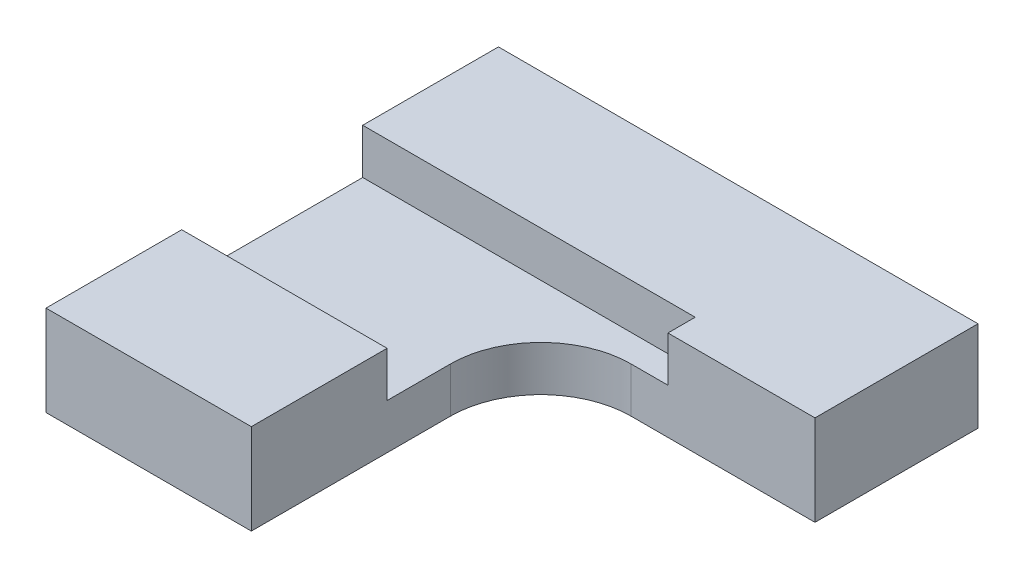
ISO-10303-21;
HEADER;
FILE_DESCRIPTION(('STEP AP214'),'2;1');
FILE_NAME('part.step','',(''),(''),'','','');
FILE_SCHEMA(('AUTOMOTIVE_DESIGN { 1 0 10303 214 1 1 1 1 }'));
ENDSEC;
DATA;
#1=APPLICATION_CONTEXT('core data for automotive mechanical design processes');
#2=APPLICATION_PROTOCOL_DEFINITION('international standard','automotive_design',2000,#1);
#3=PRODUCT_CONTEXT('',#1,'mechanical');
#4=PRODUCT('Part','Part','',(#3));
#5=PRODUCT_RELATED_PRODUCT_CATEGORY('part','',(#4));
#6=PRODUCT_DEFINITION_FORMATION('','',#4);
#7=PRODUCT_DEFINITION_CONTEXT('part definition',#1,'design');
#8=PRODUCT_DEFINITION('design','',#6,#7);
#9=PRODUCT_DEFINITION_SHAPE('','',#8);
#10=(LENGTH_UNIT() NAMED_UNIT(*) SI_UNIT(.MILLI.,.METRE.));
#11=(NAMED_UNIT(*) PLANE_ANGLE_UNIT() SI_UNIT($,.RADIAN.));
#12=(NAMED_UNIT(*) SI_UNIT($,.STERADIAN.) SOLID_ANGLE_UNIT());
#13=UNCERTAINTY_MEASURE_WITH_UNIT(LENGTH_MEASURE(1.E-05),#10,'distance_accuracy_value','');
#14=(GEOMETRIC_REPRESENTATION_CONTEXT(3) GLOBAL_UNCERTAINTY_ASSIGNED_CONTEXT((#13)) GLOBAL_UNIT_ASSIGNED_CONTEXT((#10,
#11,#12)) REPRESENTATION_CONTEXT('',''));
#15=CARTESIAN_POINT('',(0.,0.,0.));
#16=DIRECTION('',(0.,0.,1.));
#17=DIRECTION('',(1.,0.,0.));
#18=AXIS2_PLACEMENT_3D('',#15,#16,#17);
#19=CARTESIAN_POINT('',(5.9443903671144,-10.,3.01596790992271));
#20=DIRECTION('',(0.,1.,0.));
#21=DIRECTION('',(0.,0.,1.));
#22=AXIS2_PLACEMENT_3D('',#19,#20,#21);
#23=CYLINDRICAL_SURFACE('',#22,10.);
#24=CARTESIAN_POINT('',(5.9443903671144,-5.00000000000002,3.01596790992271));
#25=DIRECTION('',(0.,1.,0.));
#26=DIRECTION('',(0.,0.,1.));
#27=AXIS2_PLACEMENT_3D('',#24,#25,#26);
#28=CIRCLE('',#27,10.);
#29=CARTESIAN_POINT('',(-4.0556096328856,-5.00000000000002,3.01596790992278));
#30=VERTEX_POINT('',#29);
#31=CARTESIAN_POINT('',(5.94439036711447,-5.00000000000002,-6.98403209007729));
#32=VERTEX_POINT('',#31);
#33=EDGE_CURVE('E203',#30,#32,#28,.F.);
#34=ORIENTED_EDGE('',*,*,#33,.F.);
#35=DIRECTION('',(0.,1.,0.));
#36=VECTOR('',#35,1.);
#37=CARTESIAN_POINT('',(-4.0556096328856,-10.,3.01596790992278));
#38=LINE('',#37,#36);
#39=CARTESIAN_POINT('',(-4.0556096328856,-10.,3.01596790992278));
#40=VERTEX_POINT('',#39);
#41=EDGE_CURVE('E289',#40,#30,#38,.T.);
#42=ORIENTED_EDGE('',*,*,#41,.F.);
#43=CARTESIAN_POINT('',(5.9443903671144,-10.,3.01596790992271));
#44=DIRECTION('',(0.,1.,0.));
#45=DIRECTION('',(0.,0.,1.));
#46=AXIS2_PLACEMENT_3D('',#43,#44,#45);
#47=CIRCLE('',#46,10.);
#48=CARTESIAN_POINT('',(5.94439036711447,-10.,-6.98403209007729));
#49=VERTEX_POINT('',#48);
#50=EDGE_CURVE('E266',#49,#40,#47,.T.);
#51=ORIENTED_EDGE('',*,*,#50,.F.);
#52=DIRECTION('',(0.,1.,0.));
#53=VECTOR('',#52,1.);
#54=CARTESIAN_POINT('',(5.94439036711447,-10.,-6.98403209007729));
#55=LINE('',#54,#53);
#56=EDGE_CURVE('E292',#49,#32,#55,.T.);
#57=ORIENTED_EDGE('',*,*,#56,.T.);
#58=EDGE_LOOP('',(#34,#42,#51,#57));
#59=FACE_BOUND('',#58,.T.);
#60=ADVANCED_FACE('F33',(#59),#23,.F.);
#61=CARTESIAN_POINT('',(0.,0.,0.));
#62=DIRECTION('',(0.,1.,0.));
#63=DIRECTION('',(0.,0.,1.));
#64=AXIS2_PLACEMENT_3D('',#61,#62,#63);
#65=PLANE('',#64);
#66=DIRECTION('',(-1.,0.,0.));
#67=VECTOR('',#66,1.);
#68=CARTESIAN_POINT('',(0.,0.,-10.));
#69=LINE('',#68,#67);
#70=CARTESIAN_POINT('',(10.,0.,-10.));
#71=VERTEX_POINT('',#70);
#72=CARTESIAN_POINT('',(-26.7491169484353,0.,-10.));
#73=VERTEX_POINT('',#72);
#74=EDGE_CURVE('E41',#71,#73,#69,.T.);
#75=ORIENTED_EDGE('',*,*,#74,.F.);
#76=DIRECTION('',(0.,0.,-1.));
#77=VECTOR('',#76,1.);
#78=CARTESIAN_POINT('',(10.,0.,0.));
#79=LINE('',#78,#77);
#80=CARTESIAN_POINT('',(10.,0.,-6.98403209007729));
#81=VERTEX_POINT('',#80);
#82=EDGE_CURVE('E186',#81,#71,#79,.T.);
#83=ORIENTED_EDGE('',*,*,#82,.F.);
#84=DIRECTION('',(-1.,0.,0.));
#85=VECTOR('',#84,1.);
#86=CARTESIAN_POINT('',(6.0602202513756,0.,-6.98403209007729));
#87=LINE('',#86,#85);
#88=CARTESIAN_POINT('',(26.2508830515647,0.,-6.98403209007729));
#89=VERTEX_POINT('',#88);
#90=EDGE_CURVE('E283',#89,#81,#87,.T.);
#91=ORIENTED_EDGE('',*,*,#90,.F.);
#92=DIRECTION('',(0.,0.,1.));
#93=VECTOR('',#92,1.);
#94=CARTESIAN_POINT('',(26.2508830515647,0.,-25.));
#95=LINE('',#94,#93);
#96=CARTESIAN_POINT('',(26.2508830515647,0.,-25.));
#97=VERTEX_POINT('',#96);
#98=EDGE_CURVE('E280',#97,#89,#95,.T.);
#99=ORIENTED_EDGE('',*,*,#98,.F.);
#100=DIRECTION('',(1.,0.,0.));
#101=VECTOR('',#100,1.);
#102=CARTESIAN_POINT('',(-26.7491169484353,0.,-25.));
#103=LINE('',#102,#101);
#104=CARTESIAN_POINT('',(-26.7491169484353,0.,-25.));
#105=VERTEX_POINT('',#104);
#106=EDGE_CURVE('E277',#105,#97,#103,.T.);
#107=ORIENTED_EDGE('',*,*,#106,.F.);
#108=DIRECTION('',(0.,0.,-1.));
#109=VECTOR('',#108,1.);
#110=CARTESIAN_POINT('',(-26.7491169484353,0.,25.));
#111=LINE('',#110,#109);
#112=EDGE_CURVE('E273',#73,#105,#111,.T.);
#113=ORIENTED_EDGE('',*,*,#112,.F.);
#114=EDGE_LOOP('',(#75,#83,#91,#99,#107,#113));
#115=FACE_BOUND('',#114,.T.);
#116=ADVANCED_FACE('F336',(#115),#65,.T.);
#117=CARTESIAN_POINT('',(-4.0556096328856,-10.,25.));
#118=DIRECTION('',(0.,0.,-1.));
#119=DIRECTION('',(-1.,0.,0.));
#120=AXIS2_PLACEMENT_3D('',#117,#118,#119);
#121=PLANE('',#120);
#122=DIRECTION('',(-1.,0.,0.));
#123=VECTOR('',#122,1.);
#124=CARTESIAN_POINT('',(-4.0556096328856,0.,25.));
#125=LINE('',#124,#123);
#126=CARTESIAN_POINT('',(-4.0556096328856,0.,25.));
#127=VERTEX_POINT('',#126);
#128=CARTESIAN_POINT('',(-26.7491169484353,0.,25.));
#129=VERTEX_POINT('',#128);
#130=EDGE_CURVE('E245',#127,#129,#125,.T.);
#131=ORIENTED_EDGE('',*,*,#130,.T.);
#132=DIRECTION('',(0.,1.,0.));
#133=VECTOR('',#132,1.);
#134=CARTESIAN_POINT('',(-26.7491169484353,-10.,25.));
#135=LINE('',#134,#133);
#136=CARTESIAN_POINT('',(-26.7491169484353,-10.,25.));
#137=VERTEX_POINT('',#136);
#138=EDGE_CURVE('E304',#137,#129,#135,.T.);
#139=ORIENTED_EDGE('',*,*,#138,.F.);
#140=DIRECTION('',(-1.,0.,0.));
#141=VECTOR('',#140,1.);
#142=CARTESIAN_POINT('',(-4.0556096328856,-10.,25.));
#143=LINE('',#142,#141);
#144=CARTESIAN_POINT('',(-4.0556096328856,-10.,25.));
#145=VERTEX_POINT('',#144);
#146=EDGE_CURVE('E252',#145,#137,#143,.T.);
#147=ORIENTED_EDGE('',*,*,#146,.F.);
#148=DIRECTION('',(0.,1.,0.));
#149=VECTOR('',#148,1.);
#150=CARTESIAN_POINT('',(-4.0556096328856,-10.,25.));
#151=LINE('',#150,#149);
#152=EDGE_CURVE('E270',#145,#127,#151,.T.);
#153=ORIENTED_EDGE('',*,*,#152,.T.);
#154=EDGE_LOOP('',(#131,#139,#147,#153));
#155=FACE_BOUND('',#154,.T.);
#156=ADVANCED_FACE('F35',(#155),#121,.F.);
#157=CARTESIAN_POINT('',(-26.7491169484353,-10.,25.));
#158=DIRECTION('',(1.,0.,0.));
#159=DIRECTION('',(0.,0.,-1.));
#160=AXIS2_PLACEMENT_3D('',#157,#158,#159);
#161=PLANE('',#160);
#162=DIRECTION('',(0.,0.,1.));
#163=VECTOR('',#162,1.);
#164=CARTESIAN_POINT('',(-26.7491169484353,-5.00000000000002,25.));
#165=LINE('',#164,#163);
#166=CARTESIAN_POINT('',(-26.7491169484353,-5.00000000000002,-10.));
#167=VERTEX_POINT('',#166);
#168=CARTESIAN_POINT('',(-26.7491169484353,-5.00000000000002,10.));
#169=VERTEX_POINT('',#168);
#170=EDGE_CURVE('E206',#167,#169,#165,.T.);
#171=ORIENTED_EDGE('',*,*,#170,.F.);
#172=DIRECTION('',(0.,1.,0.));
#173=VECTOR('',#172,1.);
#174=CARTESIAN_POINT('',(-26.7491169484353,-10.,-10.));
#175=LINE('',#174,#173);
#176=EDGE_CURVE('E193',#167,#73,#175,.T.);
#177=ORIENTED_EDGE('',*,*,#176,.T.);
#178=ORIENTED_EDGE('',*,*,#112,.T.);
#179=DIRECTION('',(0.,1.,0.));
#180=VECTOR('',#179,1.);
#181=CARTESIAN_POINT('',(-26.7491169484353,-10.,-25.));
#182=LINE('',#181,#180);
#183=CARTESIAN_POINT('',(-26.7491169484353,-10.,-25.));
#184=VERTEX_POINT('',#183);
#185=EDGE_CURVE('E301',#184,#105,#182,.T.);
#186=ORIENTED_EDGE('',*,*,#185,.F.);
#187=DIRECTION('',(0.,0.,-1.));
#188=VECTOR('',#187,1.);
#189=CARTESIAN_POINT('',(-26.7491169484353,-10.,25.));
#190=LINE('',#189,#188);
#191=EDGE_CURVE('E255',#137,#184,#190,.T.);
#192=ORIENTED_EDGE('',*,*,#191,.F.);
#193=ORIENTED_EDGE('',*,*,#138,.T.);
#194=CARTESIAN_POINT('',(-26.7491169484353,0.,10.));
#195=VERTEX_POINT('',#194);
#196=EDGE_CURVE('E274',#129,#195,#111,.T.);
#197=ORIENTED_EDGE('',*,*,#196,.T.);
#198=DIRECTION('',(0.,-1.,0.));
#199=VECTOR('',#198,1.);
#200=CARTESIAN_POINT('',(-26.7491169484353,-10.,10.));
#201=LINE('',#200,#199);
#202=EDGE_CURVE('E48',#195,#169,#201,.T.);
#203=ORIENTED_EDGE('',*,*,#202,.T.);
#204=EDGE_LOOP('',(#171,#177,#178,#186,#192,#193,#197,#203));
#205=FACE_BOUND('',#204,.T.);
#206=ADVANCED_FACE('F333',(#205),#161,.F.);
#207=CARTESIAN_POINT('',(-26.7491169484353,-10.,-25.));
#208=DIRECTION('',(0.,0.,1.));
#209=DIRECTION('',(1.,0.,0.));
#210=AXIS2_PLACEMENT_3D('',#207,#208,#209);
#211=PLANE('',#210);
#212=DIRECTION('',(1.,0.,0.));
#213=VECTOR('',#212,1.);
#214=CARTESIAN_POINT('',(-26.7491169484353,-10.,-25.));
#215=LINE('',#214,#213);
#216=CARTESIAN_POINT('',(3.5,-10.,-25.));
#217=VERTEX_POINT('',#216);
#218=CARTESIAN_POINT('',(26.2508830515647,-10.,-25.));
#219=VERTEX_POINT('',#218);
#220=EDGE_CURVE('E258',#217,#219,#215,.T.);
#221=ORIENTED_EDGE('',*,*,#220,.F.);
#222=DIRECTION('',(0.,1.,0.));
#223=VECTOR('',#222,1.);
#224=CARTESIAN_POINT('',(3.5,-16.,-25.));
#225=LINE('',#224,#223);
#226=CARTESIAN_POINT('',(3.5,-16.,-25.));
#227=VERTEX_POINT('',#226);
#228=EDGE_CURVE('E246',#227,#217,#225,.T.);
#229=ORIENTED_EDGE('',*,*,#228,.F.);
#230=DIRECTION('',(-1.,0.,0.));
#231=VECTOR('',#230,1.);
#232=CARTESIAN_POINT('',(-3.5,-16.,-25.));
#233=LINE('',#232,#231);
#234=CARTESIAN_POINT('',(-3.5,-16.,-25.));
#235=VERTEX_POINT('',#234);
#236=EDGE_CURVE('E238',#227,#235,#233,.T.);
#237=ORIENTED_EDGE('',*,*,#236,.T.);
#238=DIRECTION('',(0.,1.,0.));
#239=VECTOR('',#238,1.);
#240=CARTESIAN_POINT('',(-3.5,-16.,-25.));
#241=LINE('',#240,#239);
#242=CARTESIAN_POINT('',(-3.5,-10.,-25.));
#243=VERTEX_POINT('',#242);
#244=EDGE_CURVE('E242',#235,#243,#241,.T.);
#245=ORIENTED_EDGE('',*,*,#244,.T.);
#246=EDGE_CURVE('E259',#184,#243,#215,.T.);
#247=ORIENTED_EDGE('',*,*,#246,.F.);
#248=ORIENTED_EDGE('',*,*,#185,.T.);
#249=ORIENTED_EDGE('',*,*,#106,.T.);
#250=DIRECTION('',(0.,1.,0.));
#251=VECTOR('',#250,1.);
#252=CARTESIAN_POINT('',(26.2508830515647,-10.,-25.));
#253=LINE('',#252,#251);
#254=EDGE_CURVE('E298',#219,#97,#253,.T.);
#255=ORIENTED_EDGE('',*,*,#254,.F.);
#256=EDGE_LOOP('',(#221,#229,#237,#245,#247,#248,#249,#255));
#257=FACE_BOUND('',#256,.T.);
#258=ADVANCED_FACE('F341',(#257),#211,.F.);
#259=CARTESIAN_POINT('',(26.2508830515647,-10.,-25.));
#260=DIRECTION('',(-1.,0.,0.));
#261=DIRECTION('',(0.,0.,1.));
#262=AXIS2_PLACEMENT_3D('',#259,#260,#261);
#263=PLANE('',#262);
#264=ORIENTED_EDGE('',*,*,#98,.T.);
#265=DIRECTION('',(0.,1.,0.));
#266=VECTOR('',#265,1.);
#267=CARTESIAN_POINT('',(26.2508830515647,-10.,-6.98403209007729));
#268=LINE('',#267,#266);
#269=CARTESIAN_POINT('',(26.2508830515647,-10.,-6.98403209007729));
#270=VERTEX_POINT('',#269);
#271=EDGE_CURVE('E295',#270,#89,#268,.T.);
#272=ORIENTED_EDGE('',*,*,#271,.F.);
#273=DIRECTION('',(0.,0.,1.));
#274=VECTOR('',#273,1.);
#275=CARTESIAN_POINT('',(26.2508830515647,-10.,-25.));
#276=LINE('',#275,#274);
#277=EDGE_CURVE('E262',#219,#270,#276,.T.);
#278=ORIENTED_EDGE('',*,*,#277,.F.);
#279=ORIENTED_EDGE('',*,*,#254,.T.);
#280=EDGE_LOOP('',(#264,#272,#278,#279));
#281=FACE_BOUND('',#280,.T.);
#282=ADVANCED_FACE('F368',(#281),#263,.F.);
#283=CARTESIAN_POINT('',(6.0602202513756,-10.,-6.98403209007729));
#284=DIRECTION('',(0.,0.,-1.));
#285=DIRECTION('',(-1.,0.,0.));
#286=AXIS2_PLACEMENT_3D('',#283,#284,#285);
#287=PLANE('',#286);
#288=ORIENTED_EDGE('',*,*,#90,.T.);
#289=DIRECTION('',(0.,-1.,0.));
#290=VECTOR('',#289,1.);
#291=CARTESIAN_POINT('',(10.,-10.,-6.98403209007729));
#292=LINE('',#291,#290);
#293=CARTESIAN_POINT('',(10.,-5.00000000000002,-6.98403209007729));
#294=VERTEX_POINT('',#293);
#295=EDGE_CURVE('E200',#81,#294,#292,.T.);
#296=ORIENTED_EDGE('',*,*,#295,.T.);
#297=DIRECTION('',(1.,0.,0.));
#298=VECTOR('',#297,1.);
#299=CARTESIAN_POINT('',(6.0602202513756,-5.00000000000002,-6.98403209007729));
#300=LINE('',#299,#298);
#301=EDGE_CURVE('E177',#32,#294,#300,.T.);
#302=ORIENTED_EDGE('',*,*,#301,.F.);
#303=ORIENTED_EDGE('',*,*,#56,.F.);
#304=DIRECTION('',(-1.,0.,0.));
#305=VECTOR('',#304,1.);
#306=CARTESIAN_POINT('',(26.2508830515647,-10.,-6.98403209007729));
#307=LINE('',#306,#305);
#308=EDGE_CURVE('E264',#270,#49,#307,.T.);
#309=ORIENTED_EDGE('',*,*,#308,.F.);
#310=ORIENTED_EDGE('',*,*,#271,.T.);
#311=EDGE_LOOP('',(#288,#296,#302,#303,#309,#310));
#312=FACE_BOUND('',#311,.T.);
#313=ADVANCED_FACE('F365',(#312),#287,.F.);
#314=CARTESIAN_POINT('',(-4.0556096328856,-10.,3.13179779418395));
#315=DIRECTION('',(-1.,0.,0.));
#316=DIRECTION('',(0.,0.,1.));
#317=AXIS2_PLACEMENT_3D('',#314,#315,#316);
#318=PLANE('',#317);
#319=DIRECTION('',(0.,0.,-1.));
#320=VECTOR('',#319,1.);
#321=CARTESIAN_POINT('',(-4.0556096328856,-5.00000000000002,3.13179779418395));
#322=LINE('',#321,#320);
#323=CARTESIAN_POINT('',(-4.0556096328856,-5.00000000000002,10.));
#324=VERTEX_POINT('',#323);
#325=EDGE_CURVE('E11',#324,#30,#322,.T.);
#326=ORIENTED_EDGE('',*,*,#325,.F.);
#327=DIRECTION('',(0.,1.,0.));
#328=VECTOR('',#327,1.);
#329=CARTESIAN_POINT('',(-4.0556096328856,-10.,10.));
#330=LINE('',#329,#328);
#331=CARTESIAN_POINT('',(-4.0556096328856,0.,10.));
#332=VERTEX_POINT('',#331);
#333=EDGE_CURVE('E189',#324,#332,#330,.T.);
#334=ORIENTED_EDGE('',*,*,#333,.T.);
#335=DIRECTION('',(0.,0.,1.));
#336=VECTOR('',#335,1.);
#337=CARTESIAN_POINT('',(-4.0556096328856,0.,3.13179779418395));
#338=LINE('',#337,#336);
#339=EDGE_CURVE('E256',#332,#127,#338,.T.);
#340=ORIENTED_EDGE('',*,*,#339,.T.);
#341=ORIENTED_EDGE('',*,*,#152,.F.);
#342=DIRECTION('',(0.,0.,1.));
#343=VECTOR('',#342,1.);
#344=CARTESIAN_POINT('',(-4.0556096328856,-10.,3.01596790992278));
#345=LINE('',#344,#343);
#346=EDGE_CURVE('E268',#40,#145,#345,.T.);
#347=ORIENTED_EDGE('',*,*,#346,.F.);
#348=ORIENTED_EDGE('',*,*,#41,.T.);
#349=EDGE_LOOP('',(#326,#334,#340,#341,#347,#348));
#350=FACE_BOUND('',#349,.T.);
#351=ADVANCED_FACE('F357',(#350),#318,.F.);
#352=CARTESIAN_POINT('',(5.9443903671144,-10.,3.01596790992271));
#353=DIRECTION('',(0.,1.,0.));
#354=DIRECTION('',(0.,0.,1.));
#355=AXIS2_PLACEMENT_3D('',#352,#353,#354);
#356=PLANE('',#355);
#357=DIRECTION('',(-1.,0.,0.));
#358=VECTOR('',#357,1.);
#359=CARTESIAN_POINT('',(5.9443903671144,-10.,-3.5));
#360=LINE('',#359,#358);
#361=CARTESIAN_POINT('',(-21.2491169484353,-10.,-3.5));
#362=VERTEX_POINT('',#361);
#363=CARTESIAN_POINT('',(-25.2491169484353,-10.,-3.5));
#364=VERTEX_POINT('',#363);
#365=EDGE_CURVE('E322',#362,#364,#360,.T.);
#366=ORIENTED_EDGE('',*,*,#365,.T.);
#367=DIRECTION('',(0.,0.,1.));
#368=VECTOR('',#367,1.);
#369=CARTESIAN_POINT('',(-25.2491169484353,-10.,3.01596790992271));
#370=LINE('',#369,#368);
#371=CARTESIAN_POINT('',(-25.2491169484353,-10.,3.5));
#372=VERTEX_POINT('',#371);
#373=EDGE_CURVE('E325',#364,#372,#370,.T.);
#374=ORIENTED_EDGE('',*,*,#373,.T.);
#375=DIRECTION('',(1.,0.,0.));
#376=VECTOR('',#375,1.);
#377=CARTESIAN_POINT('',(5.9443903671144,-10.,3.5));
#378=LINE('',#377,#376);
#379=CARTESIAN_POINT('',(-21.2491169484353,-10.,3.5));
#380=VERTEX_POINT('',#379);
#381=EDGE_CURVE('E316',#372,#380,#378,.T.);
#382=ORIENTED_EDGE('',*,*,#381,.T.);
#383=DIRECTION('',(0.,0.,-1.));
#384=VECTOR('',#383,1.);
#385=CARTESIAN_POINT('',(-21.2491169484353,-10.,3.01596790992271));
#386=LINE('',#385,#384);
#387=EDGE_CURVE('E319',#380,#362,#386,.T.);
#388=ORIENTED_EDGE('',*,*,#387,.T.);
#389=EDGE_LOOP('',(#366,#374,#382,#388));
#390=FACE_BOUND('',#389,.T.);
#391=ORIENTED_EDGE('',*,*,#246,.T.);
#392=DIRECTION('',(0.,0.,1.));
#393=VECTOR('',#392,1.);
#394=CARTESIAN_POINT('',(-3.5,-10.,3.01596790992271));
#395=LINE('',#394,#393);
#396=CARTESIAN_POINT('',(-3.5,-10.,-21.));
#397=VERTEX_POINT('',#396);
#398=EDGE_CURVE('E313',#243,#397,#395,.T.);
#399=ORIENTED_EDGE('',*,*,#398,.T.);
#400=DIRECTION('',(1.,0.,0.));
#401=VECTOR('',#400,1.);
#402=CARTESIAN_POINT('',(5.9443903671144,-10.,-21.));
#403=LINE('',#402,#401);
#404=CARTESIAN_POINT('',(3.5,-10.,-21.));
#405=VERTEX_POINT('',#404);
#406=EDGE_CURVE('E307',#397,#405,#403,.T.);
#407=ORIENTED_EDGE('',*,*,#406,.T.);
#408=DIRECTION('',(0.,0.,-1.));
#409=VECTOR('',#408,1.);
#410=CARTESIAN_POINT('',(3.5,-10.,3.01596790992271));
#411=LINE('',#410,#409);
#412=EDGE_CURVE('E310',#405,#217,#411,.T.);
#413=ORIENTED_EDGE('',*,*,#412,.T.);
#414=ORIENTED_EDGE('',*,*,#220,.T.);
#415=ORIENTED_EDGE('',*,*,#277,.T.);
#416=ORIENTED_EDGE('',*,*,#308,.T.);
#417=ORIENTED_EDGE('',*,*,#50,.T.);
#418=ORIENTED_EDGE('',*,*,#346,.T.);
#419=ORIENTED_EDGE('',*,*,#146,.T.);
#420=ORIENTED_EDGE('',*,*,#191,.T.);
#421=EDGE_LOOP('',(#391,#399,#407,#413,#414,#415,#416,#417,#418,#419,#420));
#422=FACE_BOUND('',#421,.T.);
#423=ADVANCED_FACE('F345',(#390,#422),#356,.F.);
#424=CARTESIAN_POINT('',(0.,-16.,0.));
#425=DIRECTION('',(0.,1.,0.));
#426=DIRECTION('',(0.,0.,1.));
#427=AXIS2_PLACEMENT_3D('',#424,#425,#426);
#428=PLANE('',#427);
#429=DIRECTION('',(0.,0.,1.));
#430=VECTOR('',#429,1.);
#431=CARTESIAN_POINT('',(-3.5,-16.,-25.));
#432=LINE('',#431,#430);
#433=CARTESIAN_POINT('',(-3.5,-16.,-21.));
#434=VERTEX_POINT('',#433);
#435=EDGE_CURVE('E223',#235,#434,#432,.T.);
#436=ORIENTED_EDGE('',*,*,#435,.F.);
#437=ORIENTED_EDGE('',*,*,#236,.F.);
#438=DIRECTION('',(0.,0.,-1.));
#439=VECTOR('',#438,1.);
#440=CARTESIAN_POINT('',(3.5,-16.,-25.));
#441=LINE('',#440,#439);
#442=CARTESIAN_POINT('',(3.5,-16.,-21.));
#443=VERTEX_POINT('',#442);
#444=EDGE_CURVE('E235',#443,#227,#441,.T.);
#445=ORIENTED_EDGE('',*,*,#444,.F.);
#446=DIRECTION('',(1.,0.,0.));
#447=VECTOR('',#446,1.);
#448=CARTESIAN_POINT('',(-3.5,-16.,-21.));
#449=LINE('',#448,#447);
#450=EDGE_CURVE('E232',#434,#443,#449,.T.);
#451=ORIENTED_EDGE('',*,*,#450,.F.);
#452=EDGE_LOOP('',(#436,#437,#445,#451));
#453=FACE_BOUND('',#452,.T.);
#454=ADVANCED_FACE('F378',(#453),#428,.F.);
#455=CARTESIAN_POINT('',(-3.5,-16.,-21.));
#456=DIRECTION('',(0.,0.,1.));
#457=DIRECTION('',(1.,0.,0.));
#458=AXIS2_PLACEMENT_3D('',#455,#456,#457);
#459=PLANE('',#458);
#460=ORIENTED_EDGE('',*,*,#406,.F.);
#461=DIRECTION('',(0.,1.,0.));
#462=VECTOR('',#461,1.);
#463=CARTESIAN_POINT('',(-3.5,-16.,-21.));
#464=LINE('',#463,#462);
#465=EDGE_CURVE('E241',#434,#397,#464,.T.);
#466=ORIENTED_EDGE('',*,*,#465,.F.);
#467=ORIENTED_EDGE('',*,*,#450,.T.);
#468=DIRECTION('',(0.,1.,0.));
#469=VECTOR('',#468,1.);
#470=CARTESIAN_POINT('',(3.5,-16.,-21.));
#471=LINE('',#470,#469);
#472=EDGE_CURVE('E248',#443,#405,#471,.T.);
#473=ORIENTED_EDGE('',*,*,#472,.T.);
#474=EDGE_LOOP('',(#460,#466,#467,#473));
#475=FACE_BOUND('',#474,.T.);
#476=ADVANCED_FACE('F382',(#475),#459,.T.);
#477=CARTESIAN_POINT('',(3.5,-16.,-25.));
#478=DIRECTION('',(1.,0.,0.));
#479=DIRECTION('',(0.,0.,-1.));
#480=AXIS2_PLACEMENT_3D('',#477,#478,#479);
#481=PLANE('',#480);
#482=ORIENTED_EDGE('',*,*,#412,.F.);
#483=ORIENTED_EDGE('',*,*,#472,.F.);
#484=ORIENTED_EDGE('',*,*,#444,.T.);
#485=ORIENTED_EDGE('',*,*,#228,.T.);
#486=EDGE_LOOP('',(#482,#483,#484,#485));
#487=FACE_BOUND('',#486,.T.);
#488=ADVANCED_FACE('F372',(#487),#481,.T.);
#489=CARTESIAN_POINT('',(-3.5,-16.,-25.));
#490=DIRECTION('',(-1.,0.,0.));
#491=DIRECTION('',(0.,0.,1.));
#492=AXIS2_PLACEMENT_3D('',#489,#490,#491);
#493=PLANE('',#492);
#494=ORIENTED_EDGE('',*,*,#398,.F.);
#495=ORIENTED_EDGE('',*,*,#244,.F.);
#496=ORIENTED_EDGE('',*,*,#435,.T.);
#497=ORIENTED_EDGE('',*,*,#465,.T.);
#498=EDGE_LOOP('',(#494,#495,#496,#497));
#499=FACE_BOUND('',#498,.T.);
#500=ADVANCED_FACE('F380',(#499),#493,.T.);
#501=CARTESIAN_POINT('',(-25.2491169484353,-16.,-3.5));
#502=DIRECTION('',(-1.,0.,0.));
#503=DIRECTION('',(0.,0.,1.));
#504=AXIS2_PLACEMENT_3D('',#501,#502,#503);
#505=PLANE('',#504);
#506=ORIENTED_EDGE('',*,*,#373,.F.);
#507=DIRECTION('',(0.,1.,0.));
#508=VECTOR('',#507,1.);
#509=CARTESIAN_POINT('',(-25.2491169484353,-16.,-3.5));
#510=LINE('',#509,#508);
#511=CARTESIAN_POINT('',(-25.2491169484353,-16.,-3.5));
#512=VERTEX_POINT('',#511);
#513=EDGE_CURVE('E220',#512,#364,#510,.T.);
#514=ORIENTED_EDGE('',*,*,#513,.F.);
#515=DIRECTION('',(0.,0.,1.));
#516=VECTOR('',#515,1.);
#517=CARTESIAN_POINT('',(-25.2491169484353,-16.,-3.5));
#518=LINE('',#517,#516);
#519=CARTESIAN_POINT('',(-25.2491169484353,-16.,3.5));
#520=VERTEX_POINT('',#519);
#521=EDGE_CURVE('E208',#512,#520,#518,.T.);
#522=ORIENTED_EDGE('',*,*,#521,.T.);
#523=DIRECTION('',(0.,1.,0.));
#524=VECTOR('',#523,1.);
#525=CARTESIAN_POINT('',(-25.2491169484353,-16.,3.5));
#526=LINE('',#525,#524);
#527=EDGE_CURVE('E219',#520,#372,#526,.T.);
#528=ORIENTED_EDGE('',*,*,#527,.T.);
#529=EDGE_LOOP('',(#506,#514,#522,#528));
#530=FACE_BOUND('',#529,.T.);
#531=ADVANCED_FACE('F471',(#530),#505,.T.);
#532=CARTESIAN_POINT('',(-25.2491169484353,-16.,-3.5));
#533=DIRECTION('',(0.,0.,-1.));
#534=DIRECTION('',(-1.,0.,0.));
#535=AXIS2_PLACEMENT_3D('',#532,#533,#534);
#536=PLANE('',#535);
#537=ORIENTED_EDGE('',*,*,#365,.F.);
#538=DIRECTION('',(0.,1.,0.));
#539=VECTOR('',#538,1.);
#540=CARTESIAN_POINT('',(-21.2491169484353,-16.,-3.5));
#541=LINE('',#540,#539);
#542=CARTESIAN_POINT('',(-21.2491169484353,-16.,-3.5));
#543=VERTEX_POINT('',#542);
#544=EDGE_CURVE('E224',#543,#362,#541,.T.);
#545=ORIENTED_EDGE('',*,*,#544,.F.);
#546=DIRECTION('',(-1.,0.,0.));
#547=VECTOR('',#546,1.);
#548=CARTESIAN_POINT('',(-25.2491169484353,-16.,-3.5));
#549=LINE('',#548,#547);
#550=EDGE_CURVE('E216',#543,#512,#549,.T.);
#551=ORIENTED_EDGE('',*,*,#550,.T.);
#552=ORIENTED_EDGE('',*,*,#513,.T.);
#553=EDGE_LOOP('',(#537,#545,#551,#552));
#554=FACE_BOUND('',#553,.T.);
#555=ADVANCED_FACE('F479',(#554),#536,.T.);
#556=CARTESIAN_POINT('',(-21.2491169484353,-16.,-3.5));
#557=DIRECTION('',(1.,0.,0.));
#558=DIRECTION('',(0.,0.,-1.));
#559=AXIS2_PLACEMENT_3D('',#556,#557,#558);
#560=PLANE('',#559);
#561=ORIENTED_EDGE('',*,*,#387,.F.);
#562=DIRECTION('',(0.,1.,0.));
#563=VECTOR('',#562,1.);
#564=CARTESIAN_POINT('',(-21.2491169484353,-16.,3.5));
#565=LINE('',#564,#563);
#566=CARTESIAN_POINT('',(-21.2491169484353,-16.,3.5));
#567=VERTEX_POINT('',#566);
#568=EDGE_CURVE('E56',#567,#380,#565,.T.);
#569=ORIENTED_EDGE('',*,*,#568,.F.);
#570=DIRECTION('',(0.,0.,-1.));
#571=VECTOR('',#570,1.);
#572=CARTESIAN_POINT('',(-21.2491169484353,-16.,-3.5));
#573=LINE('',#572,#571);
#574=EDGE_CURVE('E213',#567,#543,#573,.T.);
#575=ORIENTED_EDGE('',*,*,#574,.T.);
#576=ORIENTED_EDGE('',*,*,#544,.T.);
#577=EDGE_LOOP('',(#561,#569,#575,#576));
#578=FACE_BOUND('',#577,.T.);
#579=ADVANCED_FACE('F486',(#578),#560,.T.);
#580=CARTESIAN_POINT('',(-25.2491169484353,-16.,3.5));
#581=DIRECTION('',(0.,0.,1.));
#582=DIRECTION('',(1.,0.,0.));
#583=AXIS2_PLACEMENT_3D('',#580,#581,#582);
#584=PLANE('',#583);
#585=ORIENTED_EDGE('',*,*,#381,.F.);
#586=ORIENTED_EDGE('',*,*,#527,.F.);
#587=DIRECTION('',(1.,0.,0.));
#588=VECTOR('',#587,1.);
#589=CARTESIAN_POINT('',(-25.2491169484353,-16.,3.5));
#590=LINE('',#589,#588);
#591=EDGE_CURVE('E211',#520,#567,#590,.T.);
#592=ORIENTED_EDGE('',*,*,#591,.T.);
#593=ORIENTED_EDGE('',*,*,#568,.T.);
#594=EDGE_LOOP('',(#585,#586,#592,#593));
#595=FACE_BOUND('',#594,.T.);
#596=ADVANCED_FACE('F494',(#595),#584,.T.);
#597=CARTESIAN_POINT('',(0.,-16.,0.));
#598=DIRECTION('',(0.,1.,0.));
#599=DIRECTION('',(0.,0.,1.));
#600=AXIS2_PLACEMENT_3D('',#597,#598,#599);
#601=PLANE('',#600);
#602=ORIENTED_EDGE('',*,*,#521,.F.);
#603=ORIENTED_EDGE('',*,*,#550,.F.);
#604=ORIENTED_EDGE('',*,*,#574,.F.);
#605=ORIENTED_EDGE('',*,*,#591,.F.);
#606=EDGE_LOOP('',(#602,#603,#604,#605));
#607=FACE_BOUND('',#606,.T.);
#608=ADVANCED_FACE('F502',(#607),#601,.F.);
#609=DIRECTION('',(1.,0.,0.));
#610=VECTOR('',#609,1.);
#611=CARTESIAN_POINT('',(0.,0.,10.));
#612=LINE('',#611,#610);
#613=EDGE_CURVE('E328',#195,#332,#612,.T.);
#614=ORIENTED_EDGE('',*,*,#613,.F.);
#615=ORIENTED_EDGE('',*,*,#196,.F.);
#616=ORIENTED_EDGE('',*,*,#130,.F.);
#617=ORIENTED_EDGE('',*,*,#339,.F.);
#618=EDGE_LOOP('',(#614,#615,#616,#617));
#619=FACE_BOUND('',#618,.T.);
#620=ADVANCED_FACE('F352',(#619),#65,.T.);
#621=CARTESIAN_POINT('',(0.,-5.00000000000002,0.));
#622=DIRECTION('',(0.,1.,0.));
#623=DIRECTION('',(0.,0.,1.));
#624=AXIS2_PLACEMENT_3D('',#621,#622,#623);
#625=PLANE('',#624);
#626=ORIENTED_EDGE('',*,*,#170,.T.);
#627=DIRECTION('',(1.,0.,0.));
#628=VECTOR('',#627,1.);
#629=CARTESIAN_POINT('',(10.,-5.00000000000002,10.));
#630=LINE('',#629,#628);
#631=EDGE_CURVE('E180',#169,#324,#630,.T.);
#632=ORIENTED_EDGE('',*,*,#631,.T.);
#633=ORIENTED_EDGE('',*,*,#325,.T.);
#634=ORIENTED_EDGE('',*,*,#33,.T.);
#635=ORIENTED_EDGE('',*,*,#301,.T.);
#636=DIRECTION('',(0.,0.,-1.));
#637=VECTOR('',#636,1.);
#638=CARTESIAN_POINT('',(10.,-5.00000000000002,10.));
#639=LINE('',#638,#637);
#640=CARTESIAN_POINT('',(10.,-5.00000000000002,-10.));
#641=VERTEX_POINT('',#640);
#642=EDGE_CURVE('E170',#294,#641,#639,.T.);
#643=ORIENTED_EDGE('',*,*,#642,.T.);
#644=DIRECTION('',(-1.,0.,0.));
#645=VECTOR('',#644,1.);
#646=CARTESIAN_POINT('',(10.,-5.00000000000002,-10.));
#647=LINE('',#646,#645);
#648=EDGE_CURVE('E174',#641,#167,#647,.T.);
#649=ORIENTED_EDGE('',*,*,#648,.T.);
#650=EDGE_LOOP('',(#626,#632,#633,#634,#635,#643,#649));
#651=FACE_BOUND('',#650,.T.);
#652=ADVANCED_FACE('F172',(#651),#625,.T.);
#653=CARTESIAN_POINT('',(10.,-5.00000000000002,-10.));
#654=DIRECTION('',(0.,0.,-1.));
#655=DIRECTION('',(-1.,0.,0.));
#656=AXIS2_PLACEMENT_3D('',#653,#654,#655);
#657=PLANE('',#656);
#658=ORIENTED_EDGE('',*,*,#648,.F.);
#659=DIRECTION('',(0.,1.,0.));
#660=VECTOR('',#659,1.);
#661=CARTESIAN_POINT('',(10.,-5.00000000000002,-10.));
#662=LINE('',#661,#660);
#663=EDGE_CURVE('E183',#641,#71,#662,.T.);
#664=ORIENTED_EDGE('',*,*,#663,.T.);
#665=ORIENTED_EDGE('',*,*,#74,.T.);
#666=ORIENTED_EDGE('',*,*,#176,.F.);
#667=EDGE_LOOP('',(#658,#664,#665,#666));
#668=FACE_BOUND('',#667,.T.);
#669=ADVANCED_FACE('F191',(#668),#657,.F.);
#670=CARTESIAN_POINT('',(10.,-5.00000000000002,10.));
#671=DIRECTION('',(1.,0.,0.));
#672=DIRECTION('',(0.,0.,-1.));
#673=AXIS2_PLACEMENT_3D('',#670,#671,#672);
#674=PLANE('',#673);
#675=ORIENTED_EDGE('',*,*,#82,.T.);
#676=ORIENTED_EDGE('',*,*,#663,.F.);
#677=ORIENTED_EDGE('',*,*,#642,.F.);
#678=ORIENTED_EDGE('',*,*,#295,.F.);
#679=EDGE_LOOP('',(#675,#676,#677,#678));
#680=FACE_BOUND('',#679,.T.);
#681=ADVANCED_FACE('F184',(#680),#674,.F.);
#682=CARTESIAN_POINT('',(10.,-5.00000000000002,10.));
#683=DIRECTION('',(0.,0.,1.));
#684=DIRECTION('',(1.,0.,0.));
#685=AXIS2_PLACEMENT_3D('',#682,#683,#684);
#686=PLANE('',#685);
#687=ORIENTED_EDGE('',*,*,#613,.T.);
#688=ORIENTED_EDGE('',*,*,#333,.F.);
#689=ORIENTED_EDGE('',*,*,#631,.F.);
#690=ORIENTED_EDGE('',*,*,#202,.F.);
#691=EDGE_LOOP('',(#687,#688,#689,#690));
#692=FACE_BOUND('',#691,.T.);
#693=ADVANCED_FACE('F353',(#692),#686,.F.);
#694=CLOSED_SHELL('',(#60,#116,#156,#206,#258,#282,#313,#351,#423,#454,#476,#488,#500,#531,#555,
#579,#596,#608,#620,#652,#669,#681,#693));
#695=MANIFOLD_SOLID_BREP('B2',#694);
#696=ADVANCED_BREP_SHAPE_REPRESENTATION('',(#18,#695),#14);
#697=SHAPE_DEFINITION_REPRESENTATION(#9,#696);
ENDSEC;
END-ISO-10303-21;
